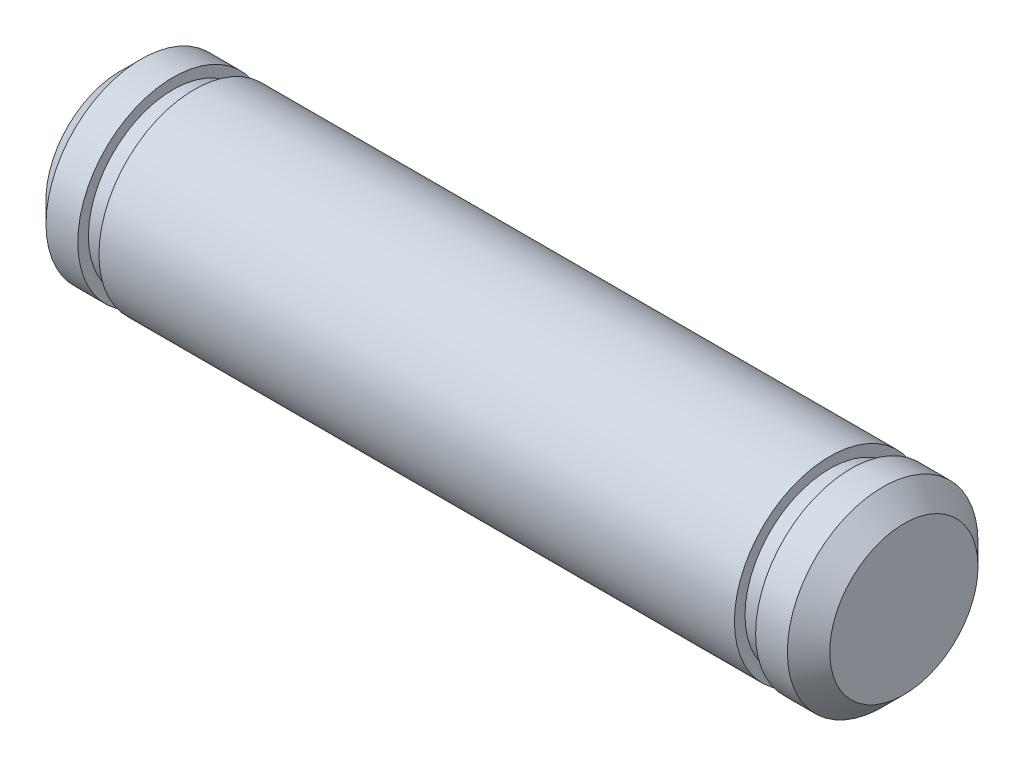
ISO-10303-21;
HEADER;
FILE_DESCRIPTION(('STEP AP214'),'2;1');
FILE_NAME('part.step','',(''),(''),'','','');
FILE_SCHEMA(('AUTOMOTIVE_DESIGN { 1 0 10303 214 1 1 1 1 }'));
ENDSEC;
DATA;
#1=APPLICATION_CONTEXT('core data for automotive mechanical design processes');
#2=APPLICATION_PROTOCOL_DEFINITION('international standard','automotive_design',2000,#1);
#3=PRODUCT_CONTEXT('',#1,'mechanical');
#4=PRODUCT('Part','Part','',(#3));
#5=PRODUCT_RELATED_PRODUCT_CATEGORY('part','',(#4));
#6=PRODUCT_DEFINITION_FORMATION('','',#4);
#7=PRODUCT_DEFINITION_CONTEXT('part definition',#1,'design');
#8=PRODUCT_DEFINITION('design','',#6,#7);
#9=PRODUCT_DEFINITION_SHAPE('','',#8);
#10=(LENGTH_UNIT() NAMED_UNIT(*) SI_UNIT(.MILLI.,.METRE.));
#11=(NAMED_UNIT(*) PLANE_ANGLE_UNIT() SI_UNIT($,.RADIAN.));
#12=(NAMED_UNIT(*) SI_UNIT($,.STERADIAN.) SOLID_ANGLE_UNIT());
#13=UNCERTAINTY_MEASURE_WITH_UNIT(LENGTH_MEASURE(1.E-05),#10,'distance_accuracy_value','');
#14=(GEOMETRIC_REPRESENTATION_CONTEXT(3) GLOBAL_UNCERTAINTY_ASSIGNED_CONTEXT((#13)) GLOBAL_UNIT_ASSIGNED_CONTEXT((#10,
#11,#12)) REPRESENTATION_CONTEXT('',''));
#15=CARTESIAN_POINT('',(0.,0.,0.));
#16=DIRECTION('',(0.,0.,1.));
#17=DIRECTION('',(1.,0.,0.));
#18=AXIS2_PLACEMENT_3D('',#15,#16,#17);
#19=CARTESIAN_POINT('',(-89.6948293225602,20.,0.));
#20=DIRECTION('',(1.,0.,0.));
#21=DIRECTION('',(0.,0.,-1.));
#22=AXIS2_PLACEMENT_3D('',#19,#20,#21);
#23=PLANE('',#22);
#24=CARTESIAN_POINT('',(-89.6948293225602,15.5,0.));
#25=DIRECTION('',(1.,0.,0.));
#26=DIRECTION('',(0.,0.,-1.));
#27=AXIS2_PLACEMENT_3D('',#24,#25,#26);
#28=CIRCLE('',#27,3.49999999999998);
#29=CARTESIAN_POINT('',(-89.6948293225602,15.5,-3.49999999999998));
#30=VERTEX_POINT('',#29);
#31=EDGE_CURVE('E28',#30,#30,#28,.F.);
#32=ORIENTED_EDGE('',*,*,#31,.T.);
#33=EDGE_LOOP('',(#32));
#34=FACE_BOUND('',#33,.T.);
#35=ADVANCED_FACE('F22',(#34),#23,.F.);
#36=CARTESIAN_POINT('',(-52.6948293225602,20.,0.));
#37=DIRECTION('',(1.,0.,0.));
#38=DIRECTION('',(0.,0.,-1.));
#39=AXIS2_PLACEMENT_3D('',#36,#37,#38);
#40=PLANE('',#39);
#41=CARTESIAN_POINT('',(-52.6948293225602,15.5,0.));
#42=DIRECTION('',(1.,0.,0.));
#43=DIRECTION('',(0.,0.,-1.));
#44=AXIS2_PLACEMENT_3D('',#41,#42,#43);
#45=CIRCLE('',#44,3.49999999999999);
#46=CARTESIAN_POINT('',(-52.6948293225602,15.5,-3.49999999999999));
#47=VERTEX_POINT('',#46);
#48=EDGE_CURVE('E32',#47,#47,#45,.T.);
#49=ORIENTED_EDGE('',*,*,#48,.T.);
#50=EDGE_LOOP('',(#49));
#51=FACE_BOUND('',#50,.T.);
#52=ADVANCED_FACE('F83',(#51),#40,.T.);
#53=CARTESIAN_POINT('',(-89.6948293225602,15.5,0.));
#54=DIRECTION('',(-1.,0.,0.));
#55=DIRECTION('',(0.,0.,1.));
#56=AXIS2_PLACEMENT_3D('',#53,#54,#55);
#57=CYLINDRICAL_SURFACE('',#56,4.5);
#58=CARTESIAN_POINT('',(-53.6948293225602,15.5,0.));
#59=DIRECTION('',(1.,0.,0.));
#60=DIRECTION('',(0.,0.,-1.));
#61=AXIS2_PLACEMENT_3D('',#58,#59,#60);
#62=CIRCLE('',#61,4.5);
#63=CARTESIAN_POINT('',(-53.6948293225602,15.5,-4.5));
#64=VERTEX_POINT('',#63);
#65=EDGE_CURVE('E36',#64,#64,#62,.F.);
#66=ORIENTED_EDGE('',*,*,#65,.T.);
#67=EDGE_LOOP('',(#66));
#68=FACE_BOUND('',#67,.T.);
#69=CARTESIAN_POINT('',(-55.1948293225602,15.5,0.));
#70=DIRECTION('',(-1.,0.,0.));
#71=DIRECTION('',(0.,0.,1.));
#72=AXIS2_PLACEMENT_3D('',#69,#70,#71);
#73=CIRCLE('',#72,4.5);
#74=CARTESIAN_POINT('',(-55.1948293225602,15.5,4.5));
#75=VERTEX_POINT('',#74);
#76=EDGE_CURVE('E41',#75,#75,#73,.T.);
#77=ORIENTED_EDGE('',*,*,#76,.F.);
#78=EDGE_LOOP('',(#77));
#79=FACE_BOUND('',#78,.T.);
#80=ADVANCED_FACE('F87',(#68,#79),#57,.T.);
#81=CARTESIAN_POINT('',(-55.1948293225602,20.,0.));
#82=DIRECTION('',(1.,0.,0.));
#83=DIRECTION('',(0.,0.,-1.));
#84=AXIS2_PLACEMENT_3D('',#81,#82,#83);
#85=PLANE('',#84);
#86=CARTESIAN_POINT('',(-55.1948293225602,15.5,0.));
#87=DIRECTION('',(-1.,0.,0.));
#88=DIRECTION('',(0.,0.,1.));
#89=AXIS2_PLACEMENT_3D('',#86,#87,#88);
#90=CIRCLE('',#89,4.);
#91=CARTESIAN_POINT('',(-55.1948293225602,15.5,4.));
#92=VERTEX_POINT('',#91);
#93=EDGE_CURVE('E44',#92,#92,#90,.T.);
#94=ORIENTED_EDGE('',*,*,#93,.F.);
#95=EDGE_LOOP('',(#94));
#96=FACE_BOUND('',#95,.T.);
#97=ORIENTED_EDGE('',*,*,#76,.T.);
#98=EDGE_LOOP('',(#97));
#99=FACE_BOUND('',#98,.T.);
#100=ADVANCED_FACE('F92',(#96,#99),#85,.F.);
#101=CARTESIAN_POINT('',(-89.6948293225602,15.5,0.));
#102=DIRECTION('',(-1.,0.,0.));
#103=DIRECTION('',(0.,0.,1.));
#104=AXIS2_PLACEMENT_3D('',#101,#102,#103);
#105=CYLINDRICAL_SURFACE('',#104,4.);
#106=CARTESIAN_POINT('',(-56.1948293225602,15.5,0.));
#107=DIRECTION('',(-1.,0.,0.));
#108=DIRECTION('',(0.,0.,1.));
#109=AXIS2_PLACEMENT_3D('',#106,#107,#108);
#110=CIRCLE('',#109,4.);
#111=CARTESIAN_POINT('',(-56.1948293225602,15.5,4.));
#112=VERTEX_POINT('',#111);
#113=EDGE_CURVE('E47',#112,#112,#110,.T.);
#114=ORIENTED_EDGE('',*,*,#113,.F.);
#115=EDGE_LOOP('',(#114));
#116=FACE_BOUND('',#115,.T.);
#117=ORIENTED_EDGE('',*,*,#93,.T.);
#118=EDGE_LOOP('',(#117));
#119=FACE_BOUND('',#118,.T.);
#120=ADVANCED_FACE('F98',(#116,#119),#105,.T.);
#121=CARTESIAN_POINT('',(-56.1948293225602,19.5,0.));
#122=DIRECTION('',(-1.,0.,0.));
#123=DIRECTION('',(0.,0.,1.));
#124=AXIS2_PLACEMENT_3D('',#121,#122,#123);
#125=PLANE('',#124);
#126=CARTESIAN_POINT('',(-56.1948293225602,15.5,0.));
#127=DIRECTION('',(-1.,0.,0.));
#128=DIRECTION('',(0.,0.,1.));
#129=AXIS2_PLACEMENT_3D('',#126,#127,#128);
#130=CIRCLE('',#129,4.5);
#131=CARTESIAN_POINT('',(-56.1948293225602,15.5,4.5));
#132=VERTEX_POINT('',#131);
#133=EDGE_CURVE('E50',#132,#132,#130,.T.);
#134=ORIENTED_EDGE('',*,*,#133,.F.);
#135=EDGE_LOOP('',(#134));
#136=FACE_BOUND('',#135,.T.);
#137=ORIENTED_EDGE('',*,*,#113,.T.);
#138=EDGE_LOOP('',(#137));
#139=FACE_BOUND('',#138,.T.);
#140=ADVANCED_FACE('F102',(#136,#139),#125,.F.);
#141=CARTESIAN_POINT('',(-89.6948293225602,15.5,0.));
#142=DIRECTION('',(-1.,0.,0.));
#143=DIRECTION('',(0.,0.,1.));
#144=AXIS2_PLACEMENT_3D('',#141,#142,#143);
#145=CYLINDRICAL_SURFACE('',#144,4.5);
#146=ORIENTED_EDGE('',*,*,#133,.T.);
#147=EDGE_LOOP('',(#146));
#148=FACE_BOUND('',#147,.T.);
#149=CARTESIAN_POINT('',(-86.1948293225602,15.5,0.));
#150=DIRECTION('',(-1.,0.,0.));
#151=DIRECTION('',(0.,0.,1.));
#152=AXIS2_PLACEMENT_3D('',#149,#150,#151);
#153=CIRCLE('',#152,4.5);
#154=CARTESIAN_POINT('',(-86.1948293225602,15.5,4.5));
#155=VERTEX_POINT('',#154);
#156=EDGE_CURVE('E53',#155,#155,#153,.T.);
#157=ORIENTED_EDGE('',*,*,#156,.F.);
#158=EDGE_LOOP('',(#157));
#159=FACE_BOUND('',#158,.T.);
#160=ADVANCED_FACE('F106',(#148,#159),#145,.T.);
#161=CARTESIAN_POINT('',(-86.1948293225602,19.5,0.));
#162=DIRECTION('',(-1.,0.,0.));
#163=DIRECTION('',(0.,0.,1.));
#164=AXIS2_PLACEMENT_3D('',#161,#162,#163);
#165=PLANE('',#164);
#166=ORIENTED_EDGE('',*,*,#156,.T.);
#167=EDGE_LOOP('',(#166));
#168=FACE_BOUND('',#167,.T.);
#169=CARTESIAN_POINT('',(-86.1948293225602,15.5,0.));
#170=DIRECTION('',(-1.,0.,0.));
#171=DIRECTION('',(0.,0.,1.));
#172=AXIS2_PLACEMENT_3D('',#169,#170,#171);
#173=CIRCLE('',#172,4.);
#174=CARTESIAN_POINT('',(-86.1948293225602,15.5,4.));
#175=VERTEX_POINT('',#174);
#176=EDGE_CURVE('E56',#175,#175,#173,.T.);
#177=ORIENTED_EDGE('',*,*,#176,.F.);
#178=EDGE_LOOP('',(#177));
#179=FACE_BOUND('',#178,.T.);
#180=ADVANCED_FACE('F79',(#168,#179),#165,.T.);
#181=CARTESIAN_POINT('',(-89.6948293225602,15.5,0.));
#182=DIRECTION('',(-1.,0.,0.));
#183=DIRECTION('',(0.,0.,1.));
#184=AXIS2_PLACEMENT_3D('',#181,#182,#183);
#185=CYLINDRICAL_SURFACE('',#184,4.);
#186=ORIENTED_EDGE('',*,*,#176,.T.);
#187=EDGE_LOOP('',(#186));
#188=FACE_BOUND('',#187,.T.);
#189=CARTESIAN_POINT('',(-87.1948293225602,15.5,0.));
#190=DIRECTION('',(-1.,0.,0.));
#191=DIRECTION('',(0.,0.,1.));
#192=AXIS2_PLACEMENT_3D('',#189,#190,#191);
#193=CIRCLE('',#192,4.);
#194=CARTESIAN_POINT('',(-87.1948293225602,15.5,4.));
#195=VERTEX_POINT('',#194);
#196=EDGE_CURVE('E59',#195,#195,#193,.T.);
#197=ORIENTED_EDGE('',*,*,#196,.F.);
#198=EDGE_LOOP('',(#197));
#199=FACE_BOUND('',#198,.T.);
#200=ADVANCED_FACE('F70',(#188,#199),#185,.T.);
#201=CARTESIAN_POINT('',(-87.1948293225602,20.,0.));
#202=DIRECTION('',(1.,0.,0.));
#203=DIRECTION('',(0.,0.,-1.));
#204=AXIS2_PLACEMENT_3D('',#201,#202,#203);
#205=PLANE('',#204);
#206=ORIENTED_EDGE('',*,*,#196,.T.);
#207=EDGE_LOOP('',(#206));
#208=FACE_BOUND('',#207,.T.);
#209=CARTESIAN_POINT('',(-87.1948293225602,15.5,0.));
#210=DIRECTION('',(-1.,0.,0.));
#211=DIRECTION('',(0.,0.,1.));
#212=AXIS2_PLACEMENT_3D('',#209,#210,#211);
#213=CIRCLE('',#212,4.5);
#214=CARTESIAN_POINT('',(-87.1948293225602,15.5,4.5));
#215=VERTEX_POINT('',#214);
#216=EDGE_CURVE('E62',#215,#215,#213,.T.);
#217=ORIENTED_EDGE('',*,*,#216,.F.);
#218=EDGE_LOOP('',(#217));
#219=FACE_BOUND('',#218,.T.);
#220=ADVANCED_FACE('F68',(#208,#219),#205,.T.);
#221=CARTESIAN_POINT('',(-89.6948293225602,15.5,0.));
#222=DIRECTION('',(-1.,0.,0.));
#223=DIRECTION('',(0.,0.,1.));
#224=AXIS2_PLACEMENT_3D('',#221,#222,#223);
#225=CYLINDRICAL_SURFACE('',#224,4.5);
#226=CARTESIAN_POINT('',(-88.6948293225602,15.5,0.));
#227=DIRECTION('',(1.,0.,0.));
#228=DIRECTION('',(0.,0.,-1.));
#229=AXIS2_PLACEMENT_3D('',#226,#227,#228);
#230=CIRCLE('',#229,4.5);
#231=CARTESIAN_POINT('',(-88.6948293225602,15.5,-4.5));
#232=VERTEX_POINT('',#231);
#233=EDGE_CURVE('E10',#232,#232,#230,.T.);
#234=ORIENTED_EDGE('',*,*,#233,.T.);
#235=EDGE_LOOP('',(#234));
#236=FACE_BOUND('',#235,.T.);
#237=ORIENTED_EDGE('',*,*,#216,.T.);
#238=EDGE_LOOP('',(#237));
#239=FACE_BOUND('',#238,.T.);
#240=ADVANCED_FACE('F66',(#236,#239),#225,.T.);
#241=CARTESIAN_POINT('',(-53.6948293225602,15.5,0.));
#242=DIRECTION('',(-1.,0.,0.));
#243=DIRECTION('',(0.,0.,1.));
#244=AXIS2_PLACEMENT_3D('',#241,#242,#243);
#245=CONICAL_SURFACE('',#244,4.5,0.785398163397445);
#246=ORIENTED_EDGE('',*,*,#48,.F.);
#247=EDGE_LOOP('',(#246));
#248=FACE_BOUND('',#247,.T.);
#249=ORIENTED_EDGE('',*,*,#65,.F.);
#250=EDGE_LOOP('',(#249));
#251=FACE_BOUND('',#250,.T.);
#252=ADVANCED_FACE('F77',(#248,#251),#245,.T.);
#253=CARTESIAN_POINT('',(-89.6948293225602,15.5,0.));
#254=DIRECTION('',(1.,0.,0.));
#255=DIRECTION('',(0.,0.,-1.));
#256=AXIS2_PLACEMENT_3D('',#253,#254,#255);
#257=CONICAL_SURFACE('',#256,3.49999999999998,0.785398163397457);
#258=ORIENTED_EDGE('',*,*,#233,.F.);
#259=EDGE_LOOP('',(#258));
#260=FACE_BOUND('',#259,.T.);
#261=ORIENTED_EDGE('',*,*,#31,.F.);
#262=EDGE_LOOP('',(#261));
#263=FACE_BOUND('',#262,.T.);
#264=ADVANCED_FACE('F140',(#260,#263),#257,.T.);
#265=CLOSED_SHELL('',(#35,#52,#80,#100,#120,#140,#160,#180,#200,#220,#240,#252,#264));
#266=MANIFOLD_SOLID_BREP('B2',#265);
#267=ADVANCED_BREP_SHAPE_REPRESENTATION('',(#18,#266),#14);
#268=SHAPE_DEFINITION_REPRESENTATION(#9,#267);
ENDSEC;
END-ISO-10303-21;
